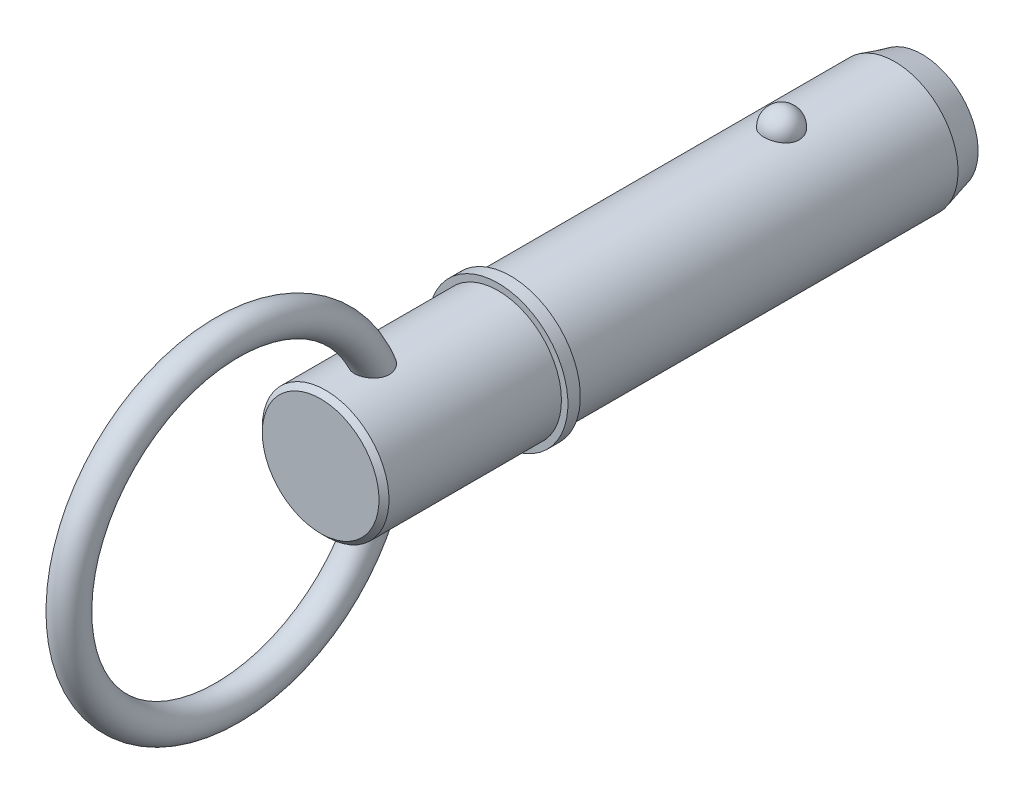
from build123d import *

# Parameters (mm, degrees)
SKETCH2_R           = 12.7
BOSS_EXTRUDE1_DEPTH = 50.8
BOSS_EXTRUDE2_START = 31.75
SKETCH3_R           = 12.7
BOSS_EXTRUDE2_DEPTH = 31.75
CHAMFER1_SIZE       = 5.5
CHAMFER1_SIZE2      = 1.473720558
SKETCH20_W          = 2.5
SKETCH20_H          = 14
SKETCH21_R          = 12.7
BOSS_EXTRUDE3_DEPTH = 38.1
CHAMFER2_SIZE       = 1
SKETCH24_R          = 3.25


with BuildPart() as part:
    # Sketch2 → Boss-Extrude1 (new body)
    with BuildSketch(Plane.XY):
        Circle(SKETCH2_R)
    extrude(amount=BOSS_EXTRUDE1_DEPTH)

    # Sketch3 → Boss-Extrude2 (add)
    with BuildSketch(Plane(origin=(0, 0, 0), x_dir=(-1, 0, 0), z_dir=(0, 0, -1)).offset(BOSS_EXTRUDE2_START)):
        Circle(SKETCH3_R)
    extrude(amount=-BOSS_EXTRUDE2_DEPTH)

    # Chamfer1
    chamfer1_edges = [part.edges().sort_by_distance(p)[0] for p in [
        (12.7, 0, -31.75),
    ]]
    chamfer1_side = [part.faces().sort_by_distance(p)[0] for p in [
        (12.7, 0, -15.875),
    ]]
    chamfer(chamfer1_edges, length=CHAMFER1_SIZE, length2=CHAMFER1_SIZE2, reference=chamfer1_side[0])

    # Sketch18 → Revolve1 (revolve)
    with BuildSketch(Plane(origin=(0, 0, 0), x_dir=(0, 0, -1), z_dir=(1, 0, 0))):
        with BuildLine():
            Line((3.56, 16.26), (3.56, 9.14))
            ThreePointArc((3.56, 9.14), (0, 12.7), (3.56, 16.26))
        make_face()
    revolve(axis=Axis((0, 16.26, -3.56), (0, -1, 0)))

    # Sketch20 → Revolve2 (revolve)
    with BuildSketch(Plane(origin=(0, 0, 0), x_dir=(0, 0, -1), z_dir=(1, 0, 0)), mode=Mode.PRIVATE) as revolve2_sk:
        with Locations((-52.05, 7)):
            Rectangle(SKETCH20_W, SKETCH20_H)
    revolve(revolve2_sk.sketch.rotate(Axis((0, 0, 33.728787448), (0, 0, 1)), 90), axis=Axis((0, 0, 33.728787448), (0, 0, 1)))

    # Sketch21 → Boss-Extrude3 (add)
    with BuildSketch(Plane(origin=(0, 0, 50.8), x_dir=(-1, 0, 0), z_dir=(0, 0, -1))):
        Circle(SKETCH21_R)
    extrude(amount=-BOSS_EXTRUDE3_DEPTH)

    # Chamfer2
    chamfer2_edges = [part.edges().sort_by_distance(p)[0] for p in [
        (12.7, 0, 88.9),
    ]]
    chamfer(chamfer2_edges, length=CHAMFER2_SIZE)

    # Sweep1: sweep along a path in Sketch23
    with BuildLine(Plane(origin=(0, 0, 0), x_dir=(0, 0, -1), z_dir=(1, 0, 0))) as sweep1_path:
        CenterArc((-107.65, 0), 31.75, 0, 360)
    # Sketch24 → Sweep1 (sweep)
    with BuildSketch(Plane(origin=(0, 0, 0), x_dir=(1, 0, 0), z_dir=(0, 1, 0))):
        with Locations((0, -75.9)):
            Circle(SKETCH24_R)
    sweep(path=sweep1_path.line)


solid = part.part
